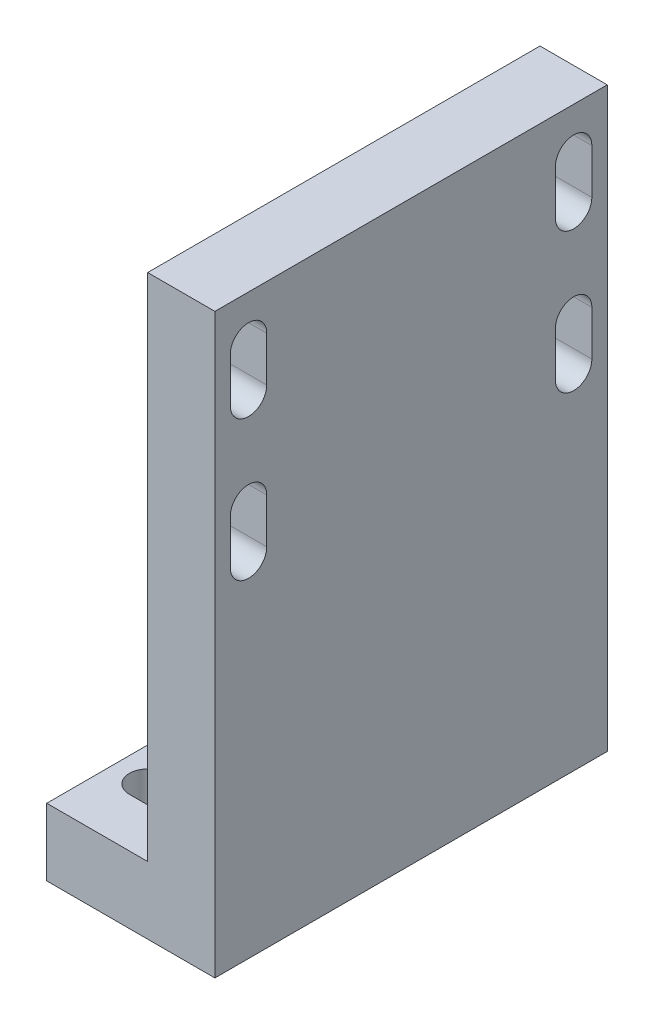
ISO-10303-21;
HEADER;
FILE_DESCRIPTION(('STEP AP214'),'2;1');
FILE_NAME('part.step','',(''),(''),'','','');
FILE_SCHEMA(('AUTOMOTIVE_DESIGN { 1 0 10303 214 1 1 1 1 }'));
ENDSEC;
DATA;
#1=APPLICATION_CONTEXT('core data for automotive mechanical design processes');
#2=APPLICATION_PROTOCOL_DEFINITION('international standard','automotive_design',2000,#1);
#3=PRODUCT_CONTEXT('',#1,'mechanical');
#4=PRODUCT('Part','Part','',(#3));
#5=PRODUCT_RELATED_PRODUCT_CATEGORY('part','',(#4));
#6=PRODUCT_DEFINITION_FORMATION('','',#4);
#7=PRODUCT_DEFINITION_CONTEXT('part definition',#1,'design');
#8=PRODUCT_DEFINITION('design','',#6,#7);
#9=PRODUCT_DEFINITION_SHAPE('','',#8);
#10=(LENGTH_UNIT() NAMED_UNIT(*) SI_UNIT(.MILLI.,.METRE.));
#11=(NAMED_UNIT(*) PLANE_ANGLE_UNIT() SI_UNIT($,.RADIAN.));
#12=(NAMED_UNIT(*) SI_UNIT($,.STERADIAN.) SOLID_ANGLE_UNIT());
#13=UNCERTAINTY_MEASURE_WITH_UNIT(LENGTH_MEASURE(1.E-05),#10,'distance_accuracy_value','');
#14=(GEOMETRIC_REPRESENTATION_CONTEXT(3) GLOBAL_UNCERTAINTY_ASSIGNED_CONTEXT((#13)) GLOBAL_UNIT_ASSIGNED_CONTEXT((#10,
#11,#12)) REPRESENTATION_CONTEXT('',''));
#15=CARTESIAN_POINT('',(0.,0.,0.));
#16=DIRECTION('',(0.,0.,1.));
#17=DIRECTION('',(1.,0.,0.));
#18=AXIS2_PLACEMENT_3D('',#15,#16,#17);
#19=CARTESIAN_POINT('',(-18.,-39.5,-35.));
#20=DIRECTION('',(0.,-1.,0.));
#21=DIRECTION('',(0.,0.,-1.));
#22=AXIS2_PLACEMENT_3D('',#19,#20,#21);
#23=PLANE('',#22);
#24=DIRECTION('',(1.,0.,0.));
#25=VECTOR('',#24,1.);
#26=CARTESIAN_POINT('',(-12.,-39.5,19.75));
#27=LINE('',#26,#25);
#28=CARTESIAN_POINT('',(-6.,-39.5,19.75));
#29=VERTEX_POINT('',#28);
#30=CARTESIAN_POINT('',(-12.,-39.5,19.75));
#31=VERTEX_POINT('',#30);
#32=EDGE_CURVE('E198',#29,#31,#27,.F.);
#33=ORIENTED_EDGE('',*,*,#32,.F.);
#34=CARTESIAN_POINT('',(-6.,-39.5,23.));
#35=DIRECTION('',(0.,1.,0.));
#36=DIRECTION('',(0.,0.,1.));
#37=AXIS2_PLACEMENT_3D('',#34,#35,#36);
#38=CIRCLE('',#37,3.25);
#39=CARTESIAN_POINT('',(-6.,-39.5,26.25));
#40=VERTEX_POINT('',#39);
#41=EDGE_CURVE('E240',#29,#40,#38,.F.);
#42=ORIENTED_EDGE('',*,*,#41,.T.);
#43=DIRECTION('',(-1.,0.,0.));
#44=VECTOR('',#43,1.);
#45=CARTESIAN_POINT('',(-12.,-39.5,26.25));
#46=LINE('',#45,#44);
#47=CARTESIAN_POINT('',(-12.,-39.5,26.25));
#48=VERTEX_POINT('',#47);
#49=EDGE_CURVE('E236',#48,#40,#46,.F.);
#50=ORIENTED_EDGE('',*,*,#49,.F.);
#51=CARTESIAN_POINT('',(-12.,-39.5,23.));
#52=DIRECTION('',(0.,1.,0.));
#53=DIRECTION('',(0.,0.,1.));
#54=AXIS2_PLACEMENT_3D('',#51,#52,#53);
#55=CIRCLE('',#54,3.25);
#56=EDGE_CURVE('E317',#48,#31,#55,.F.);
#57=ORIENTED_EDGE('',*,*,#56,.T.);
#58=EDGE_LOOP('',(#33,#42,#50,#57));
#59=FACE_BOUND('',#58,.T.);
#60=CARTESIAN_POINT('',(-12.,-39.5,-23.));
#61=DIRECTION('',(0.,1.,0.));
#62=DIRECTION('',(0.,0.,1.));
#63=AXIS2_PLACEMENT_3D('',#60,#61,#62);
#64=CIRCLE('',#63,3.25);
#65=CARTESIAN_POINT('',(-12.,-39.5,-19.75));
#66=VERTEX_POINT('',#65);
#67=CARTESIAN_POINT('',(-12.,-39.5,-26.25));
#68=VERTEX_POINT('',#67);
#69=EDGE_CURVE('E194',#66,#68,#64,.F.);
#70=ORIENTED_EDGE('',*,*,#69,.T.);
#71=DIRECTION('',(-1.,0.,0.));
#72=VECTOR('',#71,1.);
#73=CARTESIAN_POINT('',(-12.,-39.5,-26.25));
#74=LINE('',#73,#72);
#75=CARTESIAN_POINT('',(-6.,-39.5,-26.25));
#76=VERTEX_POINT('',#75);
#77=EDGE_CURVE('E191',#68,#76,#74,.F.);
#78=ORIENTED_EDGE('',*,*,#77,.T.);
#79=CARTESIAN_POINT('',(-6.,-39.5,-23.));
#80=DIRECTION('',(0.,1.,0.));
#81=DIRECTION('',(0.,0.,1.));
#82=AXIS2_PLACEMENT_3D('',#79,#80,#81);
#83=CIRCLE('',#82,3.25);
#84=CARTESIAN_POINT('',(-6.,-39.5,-19.75));
#85=VERTEX_POINT('',#84);
#86=EDGE_CURVE('E20',#76,#85,#83,.F.);
#87=ORIENTED_EDGE('',*,*,#86,.T.);
#88=DIRECTION('',(1.,0.,0.));
#89=VECTOR('',#88,1.);
#90=CARTESIAN_POINT('',(-12.,-39.5,-19.75));
#91=LINE('',#90,#89);
#92=EDGE_CURVE('E212',#85,#66,#91,.F.);
#93=ORIENTED_EDGE('',*,*,#92,.T.);
#94=EDGE_LOOP('',(#70,#78,#87,#93));
#95=FACE_BOUND('',#94,.T.);
#96=DIRECTION('',(1.,0.,0.));
#97=VECTOR('',#96,1.);
#98=CARTESIAN_POINT('',(12.,-39.5,-35.));
#99=LINE('',#98,#97);
#100=CARTESIAN_POINT('',(0.,-39.5,-35.));
#101=VERTEX_POINT('',#100);
#102=CARTESIAN_POINT('',(-18.,-39.5,-35.));
#103=VERTEX_POINT('',#102);
#104=EDGE_CURVE('E360',#101,#103,#99,.F.);
#105=ORIENTED_EDGE('',*,*,#104,.T.);
#106=DIRECTION('',(0.,0.,-1.));
#107=VECTOR('',#106,1.);
#108=CARTESIAN_POINT('',(-18.,-39.5,0.));
#109=LINE('',#108,#107);
#110=CARTESIAN_POINT('',(-18.,-39.5,35.));
#111=VERTEX_POINT('',#110);
#112=EDGE_CURVE('E189',#103,#111,#109,.F.);
#113=ORIENTED_EDGE('',*,*,#112,.T.);
#114=DIRECTION('',(1.,0.,0.));
#115=VECTOR('',#114,1.);
#116=CARTESIAN_POINT('',(12.,-39.5,35.));
#117=LINE('',#116,#115);
#118=CARTESIAN_POINT('',(0.,-39.5,35.));
#119=VERTEX_POINT('',#118);
#120=EDGE_CURVE('E378',#111,#119,#117,.T.);
#121=ORIENTED_EDGE('',*,*,#120,.T.);
#122=DIRECTION('',(0.,0.,-1.));
#123=VECTOR('',#122,1.);
#124=CARTESIAN_POINT('',(0.,-39.5,0.));
#125=LINE('',#124,#123);
#126=EDGE_CURVE('E316',#119,#101,#125,.T.);
#127=ORIENTED_EDGE('',*,*,#126,.T.);
#128=EDGE_LOOP('',(#105,#113,#121,#127));
#129=FACE_BOUND('',#128,.T.);
#130=ADVANCED_FACE('F17',(#59,#95,#129),#23,.F.);
#131=CARTESIAN_POINT('',(-18.,0.,0.));
#132=DIRECTION('',(1.,0.,0.));
#133=DIRECTION('',(0.,0.,-1.));
#134=AXIS2_PLACEMENT_3D('',#131,#132,#133);
#135=PLANE('',#134);
#136=DIRECTION('',(0.,0.,1.));
#137=VECTOR('',#136,1.);
#138=CARTESIAN_POINT('',(-18.,-51.5,35.));
#139=LINE('',#138,#137);
#140=CARTESIAN_POINT('',(-18.,-51.5,-35.));
#141=VERTEX_POINT('',#140);
#142=CARTESIAN_POINT('',(-18.,-51.5,35.));
#143=VERTEX_POINT('',#142);
#144=EDGE_CURVE('E387',#141,#143,#139,.T.);
#145=ORIENTED_EDGE('',*,*,#144,.T.);
#146=DIRECTION('',(0.,1.,0.));
#147=VECTOR('',#146,1.);
#148=CARTESIAN_POINT('',(-18.,51.5,35.));
#149=LINE('',#148,#147);
#150=EDGE_CURVE('E375',#143,#111,#149,.T.);
#151=ORIENTED_EDGE('',*,*,#150,.T.);
#152=ORIENTED_EDGE('',*,*,#112,.F.);
#153=DIRECTION('',(0.,-1.,0.));
#154=VECTOR('',#153,1.);
#155=CARTESIAN_POINT('',(-18.,51.5,-35.));
#156=LINE('',#155,#154);
#157=EDGE_CURVE('E363',#103,#141,#156,.T.);
#158=ORIENTED_EDGE('',*,*,#157,.T.);
#159=EDGE_LOOP('',(#145,#151,#152,#158));
#160=FACE_BOUND('',#159,.T.);
#161=ADVANCED_FACE('F729',(#160),#135,.F.);
#162=CARTESIAN_POINT('',(-6.,-51.5,-23.));
#163=DIRECTION('',(0.,1.,0.));
#164=DIRECTION('',(0.,0.,1.));
#165=AXIS2_PLACEMENT_3D('',#162,#163,#164);
#166=CYLINDRICAL_SURFACE('',#165,3.25);
#167=DIRECTION('',(0.,1.,0.));
#168=VECTOR('',#167,1.);
#169=CARTESIAN_POINT('',(-6.,-51.5,-26.25));
#170=LINE('',#169,#168);
#171=CARTESIAN_POINT('',(-6.,-51.5,-26.25));
#172=VERTEX_POINT('',#171);
#173=EDGE_CURVE('E183',#76,#172,#170,.F.);
#174=ORIENTED_EDGE('',*,*,#173,.T.);
#175=CARTESIAN_POINT('',(-6.,-51.5,-23.));
#176=DIRECTION('',(0.,1.,0.));
#177=DIRECTION('',(0.,0.,1.));
#178=AXIS2_PLACEMENT_3D('',#175,#176,#177);
#179=CIRCLE('',#178,3.25);
#180=CARTESIAN_POINT('',(-6.,-51.5,-19.75));
#181=VERTEX_POINT('',#180);
#182=EDGE_CURVE('E302',#172,#181,#179,.F.);
#183=ORIENTED_EDGE('',*,*,#182,.T.);
#184=DIRECTION('',(0.,1.,0.));
#185=VECTOR('',#184,1.);
#186=CARTESIAN_POINT('',(-6.,-51.5,-19.75));
#187=LINE('',#186,#185);
#188=EDGE_CURVE('E186',#181,#85,#187,.T.);
#189=ORIENTED_EDGE('',*,*,#188,.T.);
#190=ORIENTED_EDGE('',*,*,#86,.F.);
#191=EDGE_LOOP('',(#174,#183,#189,#190));
#192=FACE_BOUND('',#191,.T.);
#193=ADVANCED_FACE('F181',(#192),#166,.F.);
#194=CARTESIAN_POINT('',(-12.,-51.5,-19.75));
#195=DIRECTION('',(0.,0.,1.));
#196=DIRECTION('',(1.,0.,0.));
#197=AXIS2_PLACEMENT_3D('',#194,#195,#196);
#198=PLANE('',#197);
#199=ORIENTED_EDGE('',*,*,#188,.F.);
#200=DIRECTION('',(1.,0.,0.));
#201=VECTOR('',#200,1.);
#202=CARTESIAN_POINT('',(12.,-51.5,-19.75));
#203=LINE('',#202,#201);
#204=CARTESIAN_POINT('',(-12.,-51.5,-19.75));
#205=VERTEX_POINT('',#204);
#206=EDGE_CURVE('E301',#181,#205,#203,.F.);
#207=ORIENTED_EDGE('',*,*,#206,.T.);
#208=DIRECTION('',(0.,1.,0.));
#209=VECTOR('',#208,1.);
#210=CARTESIAN_POINT('',(-12.,-51.5,-19.75));
#211=LINE('',#210,#209);
#212=EDGE_CURVE('E207',#205,#66,#211,.T.);
#213=ORIENTED_EDGE('',*,*,#212,.T.);
#214=ORIENTED_EDGE('',*,*,#92,.F.);
#215=EDGE_LOOP('',(#199,#207,#213,#214));
#216=FACE_BOUND('',#215,.T.);
#217=ADVANCED_FACE('F710',(#216),#198,.F.);
#218=CARTESIAN_POINT('',(-12.,-51.5,-23.));
#219=DIRECTION('',(0.,1.,0.));
#220=DIRECTION('',(0.,0.,1.));
#221=AXIS2_PLACEMENT_3D('',#218,#219,#220);
#222=CYLINDRICAL_SURFACE('',#221,3.25);
#223=ORIENTED_EDGE('',*,*,#212,.F.);
#224=CARTESIAN_POINT('',(-12.,-51.5,-23.));
#225=DIRECTION('',(0.,1.,0.));
#226=DIRECTION('',(0.,0.,1.));
#227=AXIS2_PLACEMENT_3D('',#224,#225,#226);
#228=CIRCLE('',#227,3.25);
#229=CARTESIAN_POINT('',(-12.,-51.5,-26.25));
#230=VERTEX_POINT('',#229);
#231=EDGE_CURVE('E299',#205,#230,#228,.F.);
#232=ORIENTED_EDGE('',*,*,#231,.T.);
#233=DIRECTION('',(0.,1.,0.));
#234=VECTOR('',#233,1.);
#235=CARTESIAN_POINT('',(-12.,-51.5,-26.25));
#236=LINE('',#235,#234);
#237=EDGE_CURVE('E199',#230,#68,#236,.T.);
#238=ORIENTED_EDGE('',*,*,#237,.T.);
#239=ORIENTED_EDGE('',*,*,#69,.F.);
#240=EDGE_LOOP('',(#223,#232,#238,#239));
#241=FACE_BOUND('',#240,.T.);
#242=ADVANCED_FACE('F701',(#241),#222,.F.);
#243=CARTESIAN_POINT('',(-12.,-51.5,-26.25));
#244=DIRECTION('',(0.,0.,-1.));
#245=DIRECTION('',(-1.,0.,0.));
#246=AXIS2_PLACEMENT_3D('',#243,#244,#245);
#247=PLANE('',#246);
#248=ORIENTED_EDGE('',*,*,#237,.F.);
#249=DIRECTION('',(1.,0.,0.));
#250=VECTOR('',#249,1.);
#251=CARTESIAN_POINT('',(12.,-51.5,-26.25));
#252=LINE('',#251,#250);
#253=EDGE_CURVE('E203',#230,#172,#252,.T.);
#254=ORIENTED_EDGE('',*,*,#253,.T.);
#255=ORIENTED_EDGE('',*,*,#173,.F.);
#256=ORIENTED_EDGE('',*,*,#77,.F.);
#257=EDGE_LOOP('',(#248,#254,#255,#256));
#258=FACE_BOUND('',#257,.T.);
#259=ADVANCED_FACE('F201',(#258),#247,.F.);
#260=CARTESIAN_POINT('',(-12.,-51.5,19.75));
#261=DIRECTION('',(0.,0.,1.));
#262=DIRECTION('',(1.,0.,0.));
#263=AXIS2_PLACEMENT_3D('',#260,#261,#262);
#264=PLANE('',#263);
#265=DIRECTION('',(1.,0.,0.));
#266=VECTOR('',#265,1.);
#267=CARTESIAN_POINT('',(12.,-51.5,19.75));
#268=LINE('',#267,#266);
#269=CARTESIAN_POINT('',(-12.,-51.5,19.75));
#270=VERTEX_POINT('',#269);
#271=CARTESIAN_POINT('',(-6.,-51.5,19.75));
#272=VERTEX_POINT('',#271);
#273=EDGE_CURVE('E298',#270,#272,#268,.T.);
#274=ORIENTED_EDGE('',*,*,#273,.T.);
#275=DIRECTION('',(0.,1.,0.));
#276=VECTOR('',#275,1.);
#277=CARTESIAN_POINT('',(-6.,-51.5,19.75));
#278=LINE('',#277,#276);
#279=EDGE_CURVE('E241',#272,#29,#278,.T.);
#280=ORIENTED_EDGE('',*,*,#279,.T.);
#281=ORIENTED_EDGE('',*,*,#32,.T.);
#282=DIRECTION('',(0.,1.,0.));
#283=VECTOR('',#282,1.);
#284=CARTESIAN_POINT('',(-12.,-51.5,19.75));
#285=LINE('',#284,#283);
#286=EDGE_CURVE('E330',#31,#270,#285,.F.);
#287=ORIENTED_EDGE('',*,*,#286,.T.);
#288=EDGE_LOOP('',(#274,#280,#281,#287));
#289=FACE_BOUND('',#288,.T.);
#290=ADVANCED_FACE('F683',(#289),#264,.T.);
#291=CARTESIAN_POINT('',(-6.,-51.5,23.));
#292=DIRECTION('',(0.,1.,0.));
#293=DIRECTION('',(0.,0.,1.));
#294=AXIS2_PLACEMENT_3D('',#291,#292,#293);
#295=CYLINDRICAL_SURFACE('',#294,3.25);
#296=ORIENTED_EDGE('',*,*,#279,.F.);
#297=CARTESIAN_POINT('',(-6.,-51.5,23.));
#298=DIRECTION('',(0.,1.,0.));
#299=DIRECTION('',(0.,0.,1.));
#300=AXIS2_PLACEMENT_3D('',#297,#298,#299);
#301=CIRCLE('',#300,3.25);
#302=CARTESIAN_POINT('',(-6.,-51.5,26.25));
#303=VERTEX_POINT('',#302);
#304=EDGE_CURVE('E296',#272,#303,#301,.F.);
#305=ORIENTED_EDGE('',*,*,#304,.T.);
#306=DIRECTION('',(0.,1.,0.));
#307=VECTOR('',#306,1.);
#308=CARTESIAN_POINT('',(-6.,-51.5,26.25));
#309=LINE('',#308,#307);
#310=EDGE_CURVE('E239',#40,#303,#309,.F.);
#311=ORIENTED_EDGE('',*,*,#310,.F.);
#312=ORIENTED_EDGE('',*,*,#41,.F.);
#313=EDGE_LOOP('',(#296,#305,#311,#312));
#314=FACE_BOUND('',#313,.T.);
#315=ADVANCED_FACE('F673',(#314),#295,.F.);
#316=CARTESIAN_POINT('',(-12.,-51.5,26.25));
#317=DIRECTION('',(0.,0.,-1.));
#318=DIRECTION('',(-1.,0.,0.));
#319=AXIS2_PLACEMENT_3D('',#316,#317,#318);
#320=PLANE('',#319);
#321=DIRECTION('',(1.,0.,0.));
#322=VECTOR('',#321,1.);
#323=CARTESIAN_POINT('',(12.,-51.5,26.25));
#324=LINE('',#323,#322);
#325=CARTESIAN_POINT('',(-12.,-51.5,26.25));
#326=VERTEX_POINT('',#325);
#327=EDGE_CURVE('E295',#303,#326,#324,.F.);
#328=ORIENTED_EDGE('',*,*,#327,.T.);
#329=DIRECTION('',(0.,1.,0.));
#330=VECTOR('',#329,1.);
#331=CARTESIAN_POINT('',(-12.,-51.5,26.25));
#332=LINE('',#331,#330);
#333=EDGE_CURVE('E320',#326,#48,#332,.T.);
#334=ORIENTED_EDGE('',*,*,#333,.T.);
#335=ORIENTED_EDGE('',*,*,#49,.T.);
#336=ORIENTED_EDGE('',*,*,#310,.T.);
#337=EDGE_LOOP('',(#328,#334,#335,#336));
#338=FACE_BOUND('',#337,.T.);
#339=ADVANCED_FACE('F663',(#338),#320,.T.);
#340=CARTESIAN_POINT('',(-12.,-51.5,23.));
#341=DIRECTION('',(0.,1.,0.));
#342=DIRECTION('',(0.,0.,1.));
#343=AXIS2_PLACEMENT_3D('',#340,#341,#342);
#344=CYLINDRICAL_SURFACE('',#343,3.25);
#345=ORIENTED_EDGE('',*,*,#333,.F.);
#346=CARTESIAN_POINT('',(-12.,-51.5,23.));
#347=DIRECTION('',(0.,1.,0.));
#348=DIRECTION('',(0.,0.,1.));
#349=AXIS2_PLACEMENT_3D('',#346,#347,#348);
#350=CIRCLE('',#349,3.25);
#351=EDGE_CURVE('E292',#326,#270,#350,.F.);
#352=ORIENTED_EDGE('',*,*,#351,.T.);
#353=ORIENTED_EDGE('',*,*,#286,.F.);
#354=ORIENTED_EDGE('',*,*,#56,.F.);
#355=EDGE_LOOP('',(#345,#352,#353,#354));
#356=FACE_BOUND('',#355,.T.);
#357=ADVANCED_FACE('F653',(#356),#344,.F.);
#358=CARTESIAN_POINT('',(0.,0.,0.));
#359=DIRECTION('',(1.,0.,0.));
#360=DIRECTION('',(0.,0.,-1.));
#361=AXIS2_PLACEMENT_3D('',#358,#359,#360);
#362=PLANE('',#361);
#363=DIRECTION('',(0.,1.,0.));
#364=VECTOR('',#363,1.);
#365=CARTESIAN_POINT('',(0.,51.5,35.));
#366=LINE('',#365,#364);
#367=CARTESIAN_POINT('',(0.,51.5,35.));
#368=VERTEX_POINT('',#367);
#369=EDGE_CURVE('E381',#119,#368,#366,.T.);
#370=ORIENTED_EDGE('',*,*,#369,.T.);
#371=DIRECTION('',(0.,0.,-1.));
#372=VECTOR('',#371,1.);
#373=CARTESIAN_POINT('',(0.,51.5,35.));
#374=LINE('',#373,#372);
#375=CARTESIAN_POINT('',(0.,51.5,-35.));
#376=VERTEX_POINT('',#375);
#377=EDGE_CURVE('E369',#368,#376,#374,.T.);
#378=ORIENTED_EDGE('',*,*,#377,.T.);
#379=DIRECTION('',(0.,-1.,0.));
#380=VECTOR('',#379,1.);
#381=CARTESIAN_POINT('',(0.,51.5,-35.));
#382=LINE('',#381,#380);
#383=EDGE_CURVE('E219',#376,#101,#382,.T.);
#384=ORIENTED_EDGE('',*,*,#383,.T.);
#385=ORIENTED_EDGE('',*,*,#126,.F.);
#386=EDGE_LOOP('',(#370,#378,#384,#385));
#387=FACE_BOUND('',#386,.T.);
#388=CARTESIAN_POINT('',(0.,43.5,29.));
#389=DIRECTION('',(-1.,0.,0.));
#390=DIRECTION('',(0.,0.,1.));
#391=AXIS2_PLACEMENT_3D('',#388,#389,#390);
#392=CIRCLE('',#391,3.25);
#393=CARTESIAN_POINT('',(0.,43.5,25.75));
#394=VERTEX_POINT('',#393);
#395=CARTESIAN_POINT('',(0.,43.5,32.25));
#396=VERTEX_POINT('',#395);
#397=EDGE_CURVE('E314',#394,#396,#392,.F.);
#398=ORIENTED_EDGE('',*,*,#397,.T.);
#399=DIRECTION('',(0.,-1.,0.));
#400=VECTOR('',#399,1.);
#401=CARTESIAN_POINT('',(0.,43.5,32.25));
#402=LINE('',#401,#400);
#403=CARTESIAN_POINT('',(0.,35.5,32.25));
#404=VERTEX_POINT('',#403);
#405=EDGE_CURVE('E226',#396,#404,#402,.T.);
#406=ORIENTED_EDGE('',*,*,#405,.T.);
#407=CARTESIAN_POINT('',(0.,35.5,29.));
#408=DIRECTION('',(-1.,0.,0.));
#409=DIRECTION('',(0.,0.,1.));
#410=AXIS2_PLACEMENT_3D('',#407,#408,#409);
#411=CIRCLE('',#410,3.25);
#412=CARTESIAN_POINT('',(0.,35.5,25.75));
#413=VERTEX_POINT('',#412);
#414=EDGE_CURVE('E310',#404,#413,#411,.F.);
#415=ORIENTED_EDGE('',*,*,#414,.T.);
#416=DIRECTION('',(0.,1.,0.));
#417=VECTOR('',#416,1.);
#418=CARTESIAN_POINT('',(0.,43.5,25.75));
#419=LINE('',#418,#417);
#420=EDGE_CURVE('E231',#413,#394,#419,.T.);
#421=ORIENTED_EDGE('',*,*,#420,.T.);
#422=EDGE_LOOP('',(#398,#406,#415,#421));
#423=FACE_BOUND('',#422,.T.);
#424=CARTESIAN_POINT('',(0.,43.5,-29.));
#425=DIRECTION('',(-1.,0.,0.));
#426=DIRECTION('',(0.,0.,1.));
#427=AXIS2_PLACEMENT_3D('',#424,#425,#426);
#428=CIRCLE('',#427,3.25);
#429=CARTESIAN_POINT('',(0.,43.5,-32.25));
#430=VERTEX_POINT('',#429);
#431=CARTESIAN_POINT('',(0.,43.5,-25.75));
#432=VERTEX_POINT('',#431);
#433=EDGE_CURVE('E229',#430,#432,#428,.F.);
#434=ORIENTED_EDGE('',*,*,#433,.T.);
#435=DIRECTION('',(0.,-1.,0.));
#436=VECTOR('',#435,1.);
#437=CARTESIAN_POINT('',(0.,43.5,-25.75));
#438=LINE('',#437,#436);
#439=CARTESIAN_POINT('',(0.,35.5,-25.75));
#440=VERTEX_POINT('',#439);
#441=EDGE_CURVE('E216',#432,#440,#438,.T.);
#442=ORIENTED_EDGE('',*,*,#441,.T.);
#443=CARTESIAN_POINT('',(0.,35.5,-29.));
#444=DIRECTION('',(-1.,0.,0.));
#445=DIRECTION('',(0.,0.,1.));
#446=AXIS2_PLACEMENT_3D('',#443,#444,#445);
#447=CIRCLE('',#446,3.25);
#448=CARTESIAN_POINT('',(0.,35.5,-32.25));
#449=VERTEX_POINT('',#448);
#450=EDGE_CURVE('E305',#440,#449,#447,.F.);
#451=ORIENTED_EDGE('',*,*,#450,.T.);
#452=DIRECTION('',(0.,1.,0.));
#453=VECTOR('',#452,1.);
#454=CARTESIAN_POINT('',(0.,43.5,-32.25));
#455=LINE('',#454,#453);
#456=EDGE_CURVE('E221',#449,#430,#455,.T.);
#457=ORIENTED_EDGE('',*,*,#456,.T.);
#458=EDGE_LOOP('',(#434,#442,#451,#457));
#459=FACE_BOUND('',#458,.T.);
#460=DIRECTION('',(0.,-1.,0.));
#461=VECTOR('',#460,1.);
#462=CARTESIAN_POINT('',(0.,18.5,-25.75));
#463=LINE('',#462,#461);
#464=CARTESIAN_POINT('',(0.,18.5,-25.75));
#465=VERTEX_POINT('',#464);
#466=CARTESIAN_POINT('',(0.,10.5,-25.75));
#467=VERTEX_POINT('',#466);
#468=EDGE_CURVE('E283',#465,#467,#463,.T.);
#469=ORIENTED_EDGE('',*,*,#468,.T.);
#470=CARTESIAN_POINT('',(0.,10.5,-29.));
#471=DIRECTION('',(-1.,0.,0.));
#472=DIRECTION('',(0.,0.,1.));
#473=AXIS2_PLACEMENT_3D('',#470,#471,#472);
#474=CIRCLE('',#473,3.25);
#475=CARTESIAN_POINT('',(0.,10.5,-32.25));
#476=VERTEX_POINT('',#475);
#477=EDGE_CURVE('E284',#467,#476,#474,.F.);
#478=ORIENTED_EDGE('',*,*,#477,.T.);
#479=DIRECTION('',(0.,1.,0.));
#480=VECTOR('',#479,1.);
#481=CARTESIAN_POINT('',(0.,18.5,-32.25));
#482=LINE('',#481,#480);
#483=CARTESIAN_POINT('',(0.,18.5,-32.25));
#484=VERTEX_POINT('',#483);
#485=EDGE_CURVE('E334',#476,#484,#482,.T.);
#486=ORIENTED_EDGE('',*,*,#485,.T.);
#487=CARTESIAN_POINT('',(0.,18.5,-29.));
#488=DIRECTION('',(-1.,0.,0.));
#489=DIRECTION('',(0.,0.,1.));
#490=AXIS2_PLACEMENT_3D('',#487,#488,#489);
#491=CIRCLE('',#490,3.25);
#492=EDGE_CURVE('E289',#484,#465,#491,.F.);
#493=ORIENTED_EDGE('',*,*,#492,.T.);
#494=EDGE_LOOP('',(#469,#478,#486,#493));
#495=FACE_BOUND('',#494,.T.);
#496=DIRECTION('',(0.,-1.,0.));
#497=VECTOR('',#496,1.);
#498=CARTESIAN_POINT('',(0.,18.5,32.25));
#499=LINE('',#498,#497);
#500=CARTESIAN_POINT('',(0.,18.5,32.25));
#501=VERTEX_POINT('',#500);
#502=CARTESIAN_POINT('',(0.,10.5,32.25));
#503=VERTEX_POINT('',#502);
#504=EDGE_CURVE('E275',#501,#503,#499,.T.);
#505=ORIENTED_EDGE('',*,*,#504,.T.);
#506=CARTESIAN_POINT('',(0.,10.5,29.));
#507=DIRECTION('',(-1.,0.,0.));
#508=DIRECTION('',(0.,0.,1.));
#509=AXIS2_PLACEMENT_3D('',#506,#507,#508);
#510=CIRCLE('',#509,3.25);
#511=CARTESIAN_POINT('',(0.,10.5,25.75));
#512=VERTEX_POINT('',#511);
#513=EDGE_CURVE('E276',#503,#512,#510,.F.);
#514=ORIENTED_EDGE('',*,*,#513,.T.);
#515=DIRECTION('',(0.,1.,0.));
#516=VECTOR('',#515,1.);
#517=CARTESIAN_POINT('',(0.,18.5,25.75));
#518=LINE('',#517,#516);
#519=CARTESIAN_POINT('',(0.,18.5,25.75));
#520=VERTEX_POINT('',#519);
#521=EDGE_CURVE('E340',#512,#520,#518,.T.);
#522=ORIENTED_EDGE('',*,*,#521,.T.);
#523=CARTESIAN_POINT('',(0.,18.5,29.));
#524=DIRECTION('',(-1.,0.,0.));
#525=DIRECTION('',(0.,0.,1.));
#526=AXIS2_PLACEMENT_3D('',#523,#524,#525);
#527=CIRCLE('',#526,3.25);
#528=EDGE_CURVE('E280',#520,#501,#527,.F.);
#529=ORIENTED_EDGE('',*,*,#528,.T.);
#530=EDGE_LOOP('',(#505,#514,#522,#529));
#531=FACE_BOUND('',#530,.T.);
#532=ADVANCED_FACE('F643',(#387,#423,#459,#495,#531),#362,.F.);
#533=CARTESIAN_POINT('',(12.,43.5,29.));
#534=DIRECTION('',(-1.,0.,0.));
#535=DIRECTION('',(0.,0.,1.));
#536=AXIS2_PLACEMENT_3D('',#533,#534,#535);
#537=CYLINDRICAL_SURFACE('',#536,3.25);
#538=DIRECTION('',(1.,0.,0.));
#539=VECTOR('',#538,1.);
#540=CARTESIAN_POINT('',(12.,43.5,25.75));
#541=LINE('',#540,#539);
#542=CARTESIAN_POINT('',(12.,43.5,25.75));
#543=VERTEX_POINT('',#542);
#544=EDGE_CURVE('E235',#394,#543,#541,.T.);
#545=ORIENTED_EDGE('',*,*,#544,.T.);
#546=CARTESIAN_POINT('',(12.,43.5,29.));
#547=DIRECTION('',(-1.,0.,0.));
#548=DIRECTION('',(0.,0.,1.));
#549=AXIS2_PLACEMENT_3D('',#546,#547,#548);
#550=CIRCLE('',#549,3.25);
#551=CARTESIAN_POINT('',(12.,43.5,32.25));
#552=VERTEX_POINT('',#551);
#553=EDGE_CURVE('E272',#552,#543,#550,.T.);
#554=ORIENTED_EDGE('',*,*,#553,.F.);
#555=DIRECTION('',(1.,0.,0.));
#556=VECTOR('',#555,1.);
#557=CARTESIAN_POINT('',(12.,43.5,32.25));
#558=LINE('',#557,#556);
#559=EDGE_CURVE('E230',#552,#396,#558,.F.);
#560=ORIENTED_EDGE('',*,*,#559,.T.);
#561=ORIENTED_EDGE('',*,*,#397,.F.);
#562=EDGE_LOOP('',(#545,#554,#560,#561));
#563=FACE_BOUND('',#562,.T.);
#564=ADVANCED_FACE('F633',(#563),#537,.F.);
#565=CARTESIAN_POINT('',(12.,43.5,25.75));
#566=DIRECTION('',(0.,0.,-1.));
#567=DIRECTION('',(0.,1.,0.));
#568=AXIS2_PLACEMENT_3D('',#565,#566,#567);
#569=PLANE('',#568);
#570=DIRECTION('',(-1.,0.,0.));
#571=VECTOR('',#570,1.);
#572=CARTESIAN_POINT('',(12.,35.5,25.75));
#573=LINE('',#572,#571);
#574=CARTESIAN_POINT('',(12.,35.5,25.75));
#575=VERTEX_POINT('',#574);
#576=EDGE_CURVE('E234',#413,#575,#573,.F.);
#577=ORIENTED_EDGE('',*,*,#576,.T.);
#578=DIRECTION('',(0.,1.,0.));
#579=VECTOR('',#578,1.);
#580=CARTESIAN_POINT('',(12.,0.,25.75));
#581=LINE('',#580,#579);
#582=EDGE_CURVE('E271',#543,#575,#581,.F.);
#583=ORIENTED_EDGE('',*,*,#582,.F.);
#584=ORIENTED_EDGE('',*,*,#544,.F.);
#585=ORIENTED_EDGE('',*,*,#420,.F.);
#586=EDGE_LOOP('',(#577,#583,#584,#585));
#587=FACE_BOUND('',#586,.T.);
#588=ADVANCED_FACE('F623',(#587),#569,.F.);
#589=CARTESIAN_POINT('',(12.,35.5,29.));
#590=DIRECTION('',(-1.,0.,0.));
#591=DIRECTION('',(0.,0.,1.));
#592=AXIS2_PLACEMENT_3D('',#589,#590,#591);
#593=CYLINDRICAL_SURFACE('',#592,3.25);
#594=DIRECTION('',(1.,0.,0.));
#595=VECTOR('',#594,1.);
#596=CARTESIAN_POINT('',(12.,35.5,32.25));
#597=LINE('',#596,#595);
#598=CARTESIAN_POINT('',(12.,35.5,32.25));
#599=VERTEX_POINT('',#598);
#600=EDGE_CURVE('E313',#404,#599,#597,.T.);
#601=ORIENTED_EDGE('',*,*,#600,.T.);
#602=CARTESIAN_POINT('',(12.,35.5,29.));
#603=DIRECTION('',(-1.,0.,0.));
#604=DIRECTION('',(0.,0.,1.));
#605=AXIS2_PLACEMENT_3D('',#602,#603,#604);
#606=CIRCLE('',#605,3.25);
#607=EDGE_CURVE('E268',#575,#599,#606,.T.);
#608=ORIENTED_EDGE('',*,*,#607,.F.);
#609=ORIENTED_EDGE('',*,*,#576,.F.);
#610=ORIENTED_EDGE('',*,*,#414,.F.);
#611=EDGE_LOOP('',(#601,#608,#609,#610));
#612=FACE_BOUND('',#611,.T.);
#613=ADVANCED_FACE('F613',(#612),#593,.F.);
#614=CARTESIAN_POINT('',(12.,43.5,32.25));
#615=DIRECTION('',(0.,0.,1.));
#616=DIRECTION('',(0.,-1.,0.));
#617=AXIS2_PLACEMENT_3D('',#614,#615,#616);
#618=PLANE('',#617);
#619=ORIENTED_EDGE('',*,*,#559,.F.);
#620=DIRECTION('',(0.,1.,0.));
#621=VECTOR('',#620,1.);
#622=CARTESIAN_POINT('',(12.,0.,32.25));
#623=LINE('',#622,#621);
#624=EDGE_CURVE('E267',#599,#552,#623,.T.);
#625=ORIENTED_EDGE('',*,*,#624,.F.);
#626=ORIENTED_EDGE('',*,*,#600,.F.);
#627=ORIENTED_EDGE('',*,*,#405,.F.);
#628=EDGE_LOOP('',(#619,#625,#626,#627));
#629=FACE_BOUND('',#628,.T.);
#630=ADVANCED_FACE('F603',(#629),#618,.F.);
#631=CARTESIAN_POINT('',(12.,43.5,-29.));
#632=DIRECTION('',(-1.,0.,0.));
#633=DIRECTION('',(0.,0.,1.));
#634=AXIS2_PLACEMENT_3D('',#631,#632,#633);
#635=CYLINDRICAL_SURFACE('',#634,3.25);
#636=DIRECTION('',(1.,0.,0.));
#637=VECTOR('',#636,1.);
#638=CARTESIAN_POINT('',(12.,43.5,-32.25));
#639=LINE('',#638,#637);
#640=CARTESIAN_POINT('',(12.,43.5,-32.25));
#641=VERTEX_POINT('',#640);
#642=EDGE_CURVE('E225',#430,#641,#639,.T.);
#643=ORIENTED_EDGE('',*,*,#642,.T.);
#644=CARTESIAN_POINT('',(12.,43.5,-29.));
#645=DIRECTION('',(-1.,0.,0.));
#646=DIRECTION('',(0.,0.,1.));
#647=AXIS2_PLACEMENT_3D('',#644,#645,#646);
#648=CIRCLE('',#647,3.25);
#649=CARTESIAN_POINT('',(12.,43.5,-25.75));
#650=VERTEX_POINT('',#649);
#651=EDGE_CURVE('E264',#650,#641,#648,.T.);
#652=ORIENTED_EDGE('',*,*,#651,.F.);
#653=DIRECTION('',(1.,0.,0.));
#654=VECTOR('',#653,1.);
#655=CARTESIAN_POINT('',(12.,43.5,-25.75));
#656=LINE('',#655,#654);
#657=EDGE_CURVE('E220',#650,#432,#656,.F.);
#658=ORIENTED_EDGE('',*,*,#657,.T.);
#659=ORIENTED_EDGE('',*,*,#433,.F.);
#660=EDGE_LOOP('',(#643,#652,#658,#659));
#661=FACE_BOUND('',#660,.T.);
#662=ADVANCED_FACE('F593',(#661),#635,.F.);
#663=CARTESIAN_POINT('',(12.,43.5,-32.25));
#664=DIRECTION('',(0.,0.,-1.));
#665=DIRECTION('',(0.,1.,0.));
#666=AXIS2_PLACEMENT_3D('',#663,#664,#665);
#667=PLANE('',#666);
#668=DIRECTION('',(-1.,0.,0.));
#669=VECTOR('',#668,1.);
#670=CARTESIAN_POINT('',(12.,35.5,-32.25));
#671=LINE('',#670,#669);
#672=CARTESIAN_POINT('',(12.,35.5,-32.25));
#673=VERTEX_POINT('',#672);
#674=EDGE_CURVE('E224',#449,#673,#671,.F.);
#675=ORIENTED_EDGE('',*,*,#674,.T.);
#676=DIRECTION('',(0.,1.,0.));
#677=VECTOR('',#676,1.);
#678=CARTESIAN_POINT('',(12.,0.,-32.25));
#679=LINE('',#678,#677);
#680=EDGE_CURVE('E263',#641,#673,#679,.F.);
#681=ORIENTED_EDGE('',*,*,#680,.F.);
#682=ORIENTED_EDGE('',*,*,#642,.F.);
#683=ORIENTED_EDGE('',*,*,#456,.F.);
#684=EDGE_LOOP('',(#675,#681,#682,#683));
#685=FACE_BOUND('',#684,.T.);
#686=ADVANCED_FACE('F583',(#685),#667,.F.);
#687=CARTESIAN_POINT('',(12.,35.5,-29.));
#688=DIRECTION('',(-1.,0.,0.));
#689=DIRECTION('',(0.,0.,1.));
#690=AXIS2_PLACEMENT_3D('',#687,#688,#689);
#691=CYLINDRICAL_SURFACE('',#690,3.25);
#692=DIRECTION('',(1.,0.,0.));
#693=VECTOR('',#692,1.);
#694=CARTESIAN_POINT('',(12.,35.5,-25.75));
#695=LINE('',#694,#693);
#696=CARTESIAN_POINT('',(12.,35.5,-25.75));
#697=VERTEX_POINT('',#696);
#698=EDGE_CURVE('E308',#440,#697,#695,.T.);
#699=ORIENTED_EDGE('',*,*,#698,.T.);
#700=CARTESIAN_POINT('',(12.,35.5,-29.));
#701=DIRECTION('',(-1.,0.,0.));
#702=DIRECTION('',(0.,0.,1.));
#703=AXIS2_PLACEMENT_3D('',#700,#701,#702);
#704=CIRCLE('',#703,3.25);
#705=EDGE_CURVE('E259',#673,#697,#704,.T.);
#706=ORIENTED_EDGE('',*,*,#705,.F.);
#707=ORIENTED_EDGE('',*,*,#674,.F.);
#708=ORIENTED_EDGE('',*,*,#450,.F.);
#709=EDGE_LOOP('',(#699,#706,#707,#708));
#710=FACE_BOUND('',#709,.T.);
#711=ADVANCED_FACE('F573',(#710),#691,.F.);
#712=CARTESIAN_POINT('',(12.,43.5,-25.75));
#713=DIRECTION('',(0.,0.,1.));
#714=DIRECTION('',(0.,-1.,0.));
#715=AXIS2_PLACEMENT_3D('',#712,#713,#714);
#716=PLANE('',#715);
#717=ORIENTED_EDGE('',*,*,#657,.F.);
#718=DIRECTION('',(0.,1.,0.));
#719=VECTOR('',#718,1.);
#720=CARTESIAN_POINT('',(12.,0.,-25.75));
#721=LINE('',#720,#719);
#722=EDGE_CURVE('E262',#697,#650,#721,.T.);
#723=ORIENTED_EDGE('',*,*,#722,.F.);
#724=ORIENTED_EDGE('',*,*,#698,.F.);
#725=ORIENTED_EDGE('',*,*,#441,.F.);
#726=EDGE_LOOP('',(#717,#723,#724,#725));
#727=FACE_BOUND('',#726,.T.);
#728=ADVANCED_FACE('F563',(#727),#716,.F.);
#729=CARTESIAN_POINT('',(12.,51.5,-35.));
#730=DIRECTION('',(0.,0.,1.));
#731=DIRECTION('',(0.,-1.,0.));
#732=AXIS2_PLACEMENT_3D('',#729,#730,#731);
#733=PLANE('',#732);
#734=ORIENTED_EDGE('',*,*,#157,.F.);
#735=ORIENTED_EDGE('',*,*,#104,.F.);
#736=ORIENTED_EDGE('',*,*,#383,.F.);
#737=DIRECTION('',(1.,0.,0.));
#738=VECTOR('',#737,1.);
#739=CARTESIAN_POINT('',(12.,51.5,-35.));
#740=LINE('',#739,#738);
#741=CARTESIAN_POINT('',(12.,51.5,-35.));
#742=VERTEX_POINT('',#741);
#743=EDGE_CURVE('E366',#376,#742,#740,.T.);
#744=ORIENTED_EDGE('',*,*,#743,.T.);
#745=DIRECTION('',(0.,1.,0.));
#746=VECTOR('',#745,1.);
#747=CARTESIAN_POINT('',(12.,0.,-35.));
#748=LINE('',#747,#746);
#749=CARTESIAN_POINT('',(12.,-51.5,-35.));
#750=VERTEX_POINT('',#749);
#751=EDGE_CURVE('E414',#750,#742,#748,.T.);
#752=ORIENTED_EDGE('',*,*,#751,.F.);
#753=DIRECTION('',(1.,0.,0.));
#754=VECTOR('',#753,1.);
#755=CARTESIAN_POINT('',(12.,-51.5,-35.));
#756=LINE('',#755,#754);
#757=EDGE_CURVE('E384',#750,#141,#756,.F.);
#758=ORIENTED_EDGE('',*,*,#757,.T.);
#759=EDGE_LOOP('',(#734,#735,#736,#744,#752,#758));
#760=FACE_BOUND('',#759,.T.);
#761=ADVANCED_FACE('F553',(#760),#733,.F.);
#762=CARTESIAN_POINT('',(12.,51.5,35.));
#763=DIRECTION('',(0.,-1.,0.));
#764=DIRECTION('',(0.,0.,-1.));
#765=AXIS2_PLACEMENT_3D('',#762,#763,#764);
#766=PLANE('',#765);
#767=DIRECTION('',(1.,0.,0.));
#768=VECTOR('',#767,1.);
#769=CARTESIAN_POINT('',(12.,51.5,35.));
#770=LINE('',#769,#768);
#771=CARTESIAN_POINT('',(12.,51.5,35.));
#772=VERTEX_POINT('',#771);
#773=EDGE_CURVE('E372',#368,#772,#770,.T.);
#774=ORIENTED_EDGE('',*,*,#773,.T.);
#775=DIRECTION('',(0.,0.,-1.));
#776=VECTOR('',#775,1.);
#777=CARTESIAN_POINT('',(12.,51.5,0.));
#778=LINE('',#777,#776);
#779=EDGE_CURVE('E417',#742,#772,#778,.F.);
#780=ORIENTED_EDGE('',*,*,#779,.F.);
#781=ORIENTED_EDGE('',*,*,#743,.F.);
#782=ORIENTED_EDGE('',*,*,#377,.F.);
#783=EDGE_LOOP('',(#774,#780,#781,#782));
#784=FACE_BOUND('',#783,.T.);
#785=ADVANCED_FACE('F543',(#784),#766,.F.);
#786=CARTESIAN_POINT('',(12.,51.5,35.));
#787=DIRECTION('',(0.,0.,-1.));
#788=DIRECTION('',(0.,1.,0.));
#789=AXIS2_PLACEMENT_3D('',#786,#787,#788);
#790=PLANE('',#789);
#791=ORIENTED_EDGE('',*,*,#120,.F.);
#792=ORIENTED_EDGE('',*,*,#150,.F.);
#793=DIRECTION('',(1.,0.,0.));
#794=VECTOR('',#793,1.);
#795=CARTESIAN_POINT('',(12.,-51.5,35.));
#796=LINE('',#795,#794);
#797=CARTESIAN_POINT('',(12.,-51.5,35.));
#798=VERTEX_POINT('',#797);
#799=EDGE_CURVE('E304',#143,#798,#796,.T.);
#800=ORIENTED_EDGE('',*,*,#799,.T.);
#801=DIRECTION('',(0.,1.,0.));
#802=VECTOR('',#801,1.);
#803=CARTESIAN_POINT('',(12.,0.,35.));
#804=LINE('',#803,#802);
#805=EDGE_CURVE('E420',#772,#798,#804,.F.);
#806=ORIENTED_EDGE('',*,*,#805,.F.);
#807=ORIENTED_EDGE('',*,*,#773,.F.);
#808=ORIENTED_EDGE('',*,*,#369,.F.);
#809=EDGE_LOOP('',(#791,#792,#800,#806,#807,#808));
#810=FACE_BOUND('',#809,.T.);
#811=ADVANCED_FACE('F533',(#810),#790,.F.);
#812=CARTESIAN_POINT('',(12.,-51.5,35.));
#813=DIRECTION('',(0.,1.,0.));
#814=DIRECTION('',(0.,0.,1.));
#815=AXIS2_PLACEMENT_3D('',#812,#813,#814);
#816=PLANE('',#815);
#817=ORIENTED_EDGE('',*,*,#327,.F.);
#818=ORIENTED_EDGE('',*,*,#304,.F.);
#819=ORIENTED_EDGE('',*,*,#273,.F.);
#820=ORIENTED_EDGE('',*,*,#351,.F.);
#821=EDGE_LOOP('',(#817,#818,#819,#820));
#822=FACE_BOUND('',#821,.T.);
#823=ORIENTED_EDGE('',*,*,#231,.F.);
#824=ORIENTED_EDGE('',*,*,#206,.F.);
#825=ORIENTED_EDGE('',*,*,#182,.F.);
#826=ORIENTED_EDGE('',*,*,#253,.F.);
#827=EDGE_LOOP('',(#823,#824,#825,#826));
#828=FACE_BOUND('',#827,.T.);
#829=ORIENTED_EDGE('',*,*,#144,.F.);
#830=ORIENTED_EDGE('',*,*,#757,.F.);
#831=DIRECTION('',(0.,0.,-1.));
#832=VECTOR('',#831,1.);
#833=CARTESIAN_POINT('',(12.,-51.5,0.));
#834=LINE('',#833,#832);
#835=EDGE_CURVE('E258',#798,#750,#834,.T.);
#836=ORIENTED_EDGE('',*,*,#835,.F.);
#837=ORIENTED_EDGE('',*,*,#799,.F.);
#838=EDGE_LOOP('',(#829,#830,#836,#837));
#839=FACE_BOUND('',#838,.T.);
#840=ADVANCED_FACE('F523',(#822,#828,#839),#816,.F.);
#841=CARTESIAN_POINT('',(12.,18.5,-29.));
#842=DIRECTION('',(-1.,0.,0.));
#843=DIRECTION('',(0.,0.,1.));
#844=AXIS2_PLACEMENT_3D('',#841,#842,#843);
#845=CYLINDRICAL_SURFACE('',#844,3.25);
#846=DIRECTION('',(1.,0.,0.));
#847=VECTOR('',#846,1.);
#848=CARTESIAN_POINT('',(12.,18.5,-32.25));
#849=LINE('',#848,#847);
#850=CARTESIAN_POINT('',(12.,18.5,-32.25));
#851=VERTEX_POINT('',#850);
#852=EDGE_CURVE('E291',#484,#851,#849,.T.);
#853=ORIENTED_EDGE('',*,*,#852,.T.);
#854=CARTESIAN_POINT('',(12.,18.5,-29.));
#855=DIRECTION('',(-1.,0.,0.));
#856=DIRECTION('',(0.,0.,1.));
#857=AXIS2_PLACEMENT_3D('',#854,#855,#856);
#858=CIRCLE('',#857,3.25);
#859=CARTESIAN_POINT('',(12.,18.5,-25.75));
#860=VERTEX_POINT('',#859);
#861=EDGE_CURVE('E255',#860,#851,#858,.T.);
#862=ORIENTED_EDGE('',*,*,#861,.F.);
#863=DIRECTION('',(1.,0.,0.));
#864=VECTOR('',#863,1.);
#865=CARTESIAN_POINT('',(12.,18.5,-25.75));
#866=LINE('',#865,#864);
#867=EDGE_CURVE('E339',#860,#465,#866,.F.);
#868=ORIENTED_EDGE('',*,*,#867,.T.);
#869=ORIENTED_EDGE('',*,*,#492,.F.);
#870=EDGE_LOOP('',(#853,#862,#868,#869));
#871=FACE_BOUND('',#870,.T.);
#872=ADVANCED_FACE('F513',(#871),#845,.F.);
#873=CARTESIAN_POINT('',(12.,18.5,-32.25));
#874=DIRECTION('',(0.,0.,-1.));
#875=DIRECTION('',(0.,1.,0.));
#876=AXIS2_PLACEMENT_3D('',#873,#874,#875);
#877=PLANE('',#876);
#878=DIRECTION('',(-1.,0.,0.));
#879=VECTOR('',#878,1.);
#880=CARTESIAN_POINT('',(12.,10.5,-32.25));
#881=LINE('',#880,#879);
#882=CARTESIAN_POINT('',(12.,10.5,-32.25));
#883=VERTEX_POINT('',#882);
#884=EDGE_CURVE('E288',#476,#883,#881,.F.);
#885=ORIENTED_EDGE('',*,*,#884,.T.);
#886=DIRECTION('',(0.,1.,0.));
#887=VECTOR('',#886,1.);
#888=CARTESIAN_POINT('',(12.,0.,-32.25));
#889=LINE('',#888,#887);
#890=EDGE_CURVE('E254',#851,#883,#889,.F.);
#891=ORIENTED_EDGE('',*,*,#890,.F.);
#892=ORIENTED_EDGE('',*,*,#852,.F.);
#893=ORIENTED_EDGE('',*,*,#485,.F.);
#894=EDGE_LOOP('',(#885,#891,#892,#893));
#895=FACE_BOUND('',#894,.T.);
#896=ADVANCED_FACE('F503',(#895),#877,.F.);
#897=CARTESIAN_POINT('',(12.,10.5,-29.));
#898=DIRECTION('',(-1.,0.,0.));
#899=DIRECTION('',(0.,0.,1.));
#900=AXIS2_PLACEMENT_3D('',#897,#898,#899);
#901=CYLINDRICAL_SURFACE('',#900,3.25);
#902=DIRECTION('',(1.,0.,0.));
#903=VECTOR('',#902,1.);
#904=CARTESIAN_POINT('',(12.,10.5,-25.75));
#905=LINE('',#904,#903);
#906=CARTESIAN_POINT('',(12.,10.5,-25.75));
#907=VERTEX_POINT('',#906);
#908=EDGE_CURVE('E287',#467,#907,#905,.T.);
#909=ORIENTED_EDGE('',*,*,#908,.T.);
#910=CARTESIAN_POINT('',(12.,10.5,-29.));
#911=DIRECTION('',(-1.,0.,0.));
#912=DIRECTION('',(0.,0.,1.));
#913=AXIS2_PLACEMENT_3D('',#910,#911,#912);
#914=CIRCLE('',#913,3.25);
#915=EDGE_CURVE('E251',#883,#907,#914,.T.);
#916=ORIENTED_EDGE('',*,*,#915,.F.);
#917=ORIENTED_EDGE('',*,*,#884,.F.);
#918=ORIENTED_EDGE('',*,*,#477,.F.);
#919=EDGE_LOOP('',(#909,#916,#917,#918));
#920=FACE_BOUND('',#919,.T.);
#921=ADVANCED_FACE('F493',(#920),#901,.F.);
#922=CARTESIAN_POINT('',(12.,18.5,-25.75));
#923=DIRECTION('',(0.,0.,1.));
#924=DIRECTION('',(0.,-1.,0.));
#925=AXIS2_PLACEMENT_3D('',#922,#923,#924);
#926=PLANE('',#925);
#927=ORIENTED_EDGE('',*,*,#867,.F.);
#928=DIRECTION('',(0.,1.,0.));
#929=VECTOR('',#928,1.);
#930=CARTESIAN_POINT('',(12.,0.,-25.75));
#931=LINE('',#930,#929);
#932=EDGE_CURVE('E250',#907,#860,#931,.T.);
#933=ORIENTED_EDGE('',*,*,#932,.F.);
#934=ORIENTED_EDGE('',*,*,#908,.F.);
#935=ORIENTED_EDGE('',*,*,#468,.F.);
#936=EDGE_LOOP('',(#927,#933,#934,#935));
#937=FACE_BOUND('',#936,.T.);
#938=ADVANCED_FACE('F483',(#937),#926,.F.);
#939=CARTESIAN_POINT('',(12.,18.5,29.));
#940=DIRECTION('',(-1.,0.,0.));
#941=DIRECTION('',(0.,0.,1.));
#942=AXIS2_PLACEMENT_3D('',#939,#940,#941);
#943=CYLINDRICAL_SURFACE('',#942,3.25);
#944=DIRECTION('',(1.,0.,0.));
#945=VECTOR('',#944,1.);
#946=CARTESIAN_POINT('',(12.,18.5,25.75));
#947=LINE('',#946,#945);
#948=CARTESIAN_POINT('',(12.,18.5,25.75));
#949=VERTEX_POINT('',#948);
#950=EDGE_CURVE('E282',#520,#949,#947,.T.);
#951=ORIENTED_EDGE('',*,*,#950,.T.);
#952=CARTESIAN_POINT('',(12.,18.5,29.));
#953=DIRECTION('',(-1.,0.,0.));
#954=DIRECTION('',(0.,0.,1.));
#955=AXIS2_PLACEMENT_3D('',#952,#953,#954);
#956=CIRCLE('',#955,3.25);
#957=CARTESIAN_POINT('',(12.,18.5,32.25));
#958=VERTEX_POINT('',#957);
#959=EDGE_CURVE('E247',#958,#949,#956,.T.);
#960=ORIENTED_EDGE('',*,*,#959,.F.);
#961=DIRECTION('',(1.,0.,0.));
#962=VECTOR('',#961,1.);
#963=CARTESIAN_POINT('',(12.,18.5,32.25));
#964=LINE('',#963,#962);
#965=EDGE_CURVE('E345',#958,#501,#964,.F.);
#966=ORIENTED_EDGE('',*,*,#965,.T.);
#967=ORIENTED_EDGE('',*,*,#528,.F.);
#968=EDGE_LOOP('',(#951,#960,#966,#967));
#969=FACE_BOUND('',#968,.T.);
#970=ADVANCED_FACE('F449',(#969),#943,.F.);
#971=CARTESIAN_POINT('',(12.,18.5,25.75));
#972=DIRECTION('',(0.,0.,-1.));
#973=DIRECTION('',(0.,1.,0.));
#974=AXIS2_PLACEMENT_3D('',#971,#972,#973);
#975=PLANE('',#974);
#976=DIRECTION('',(-1.,0.,0.));
#977=VECTOR('',#976,1.);
#978=CARTESIAN_POINT('',(12.,10.5,25.75));
#979=LINE('',#978,#977);
#980=CARTESIAN_POINT('',(12.,10.5,25.75));
#981=VERTEX_POINT('',#980);
#982=EDGE_CURVE('E279',#512,#981,#979,.F.);
#983=ORIENTED_EDGE('',*,*,#982,.T.);
#984=DIRECTION('',(0.,1.,0.));
#985=VECTOR('',#984,1.);
#986=CARTESIAN_POINT('',(12.,0.,25.75));
#987=LINE('',#986,#985);
#988=EDGE_CURVE('E246',#949,#981,#987,.F.);
#989=ORIENTED_EDGE('',*,*,#988,.F.);
#990=ORIENTED_EDGE('',*,*,#950,.F.);
#991=ORIENTED_EDGE('',*,*,#521,.F.);
#992=EDGE_LOOP('',(#983,#989,#990,#991));
#993=FACE_BOUND('',#992,.T.);
#994=ADVANCED_FACE('F436',(#993),#975,.F.);
#995=CARTESIAN_POINT('',(12.,10.5,29.));
#996=DIRECTION('',(-1.,0.,0.));
#997=DIRECTION('',(0.,0.,1.));
#998=AXIS2_PLACEMENT_3D('',#995,#996,#997);
#999=CYLINDRICAL_SURFACE('',#998,3.25);
#1000=DIRECTION('',(1.,0.,0.));
#1001=VECTOR('',#1000,1.);
#1002=CARTESIAN_POINT('',(12.,10.5,32.25));
#1003=LINE('',#1002,#1001);
#1004=CARTESIAN_POINT('',(12.,10.5,32.25));
#1005=VERTEX_POINT('',#1004);
#1006=EDGE_CURVE('E35',#503,#1005,#1003,.T.);
#1007=ORIENTED_EDGE('',*,*,#1006,.T.);
#1008=CARTESIAN_POINT('',(12.,10.5,29.));
#1009=DIRECTION('',(-1.,0.,0.));
#1010=DIRECTION('',(0.,0.,1.));
#1011=AXIS2_PLACEMENT_3D('',#1008,#1009,#1010);
#1012=CIRCLE('',#1011,3.25);
#1013=EDGE_CURVE('E26',#981,#1005,#1012,.T.);
#1014=ORIENTED_EDGE('',*,*,#1013,.F.);
#1015=ORIENTED_EDGE('',*,*,#982,.F.);
#1016=ORIENTED_EDGE('',*,*,#513,.F.);
#1017=EDGE_LOOP('',(#1007,#1014,#1015,#1016));
#1018=FACE_BOUND('',#1017,.T.);
#1019=ADVANCED_FACE('F438',(#1018),#999,.F.);
#1020=CARTESIAN_POINT('',(12.,18.5,32.25));
#1021=DIRECTION('',(0.,0.,1.));
#1022=DIRECTION('',(0.,-1.,0.));
#1023=AXIS2_PLACEMENT_3D('',#1020,#1021,#1022);
#1024=PLANE('',#1023);
#1025=ORIENTED_EDGE('',*,*,#965,.F.);
#1026=DIRECTION('',(0.,1.,0.));
#1027=VECTOR('',#1026,1.);
#1028=CARTESIAN_POINT('',(12.,0.,32.25));
#1029=LINE('',#1028,#1027);
#1030=EDGE_CURVE('E11',#1005,#958,#1029,.T.);
#1031=ORIENTED_EDGE('',*,*,#1030,.F.);
#1032=ORIENTED_EDGE('',*,*,#1006,.F.);
#1033=ORIENTED_EDGE('',*,*,#504,.F.);
#1034=EDGE_LOOP('',(#1025,#1031,#1032,#1033));
#1035=FACE_BOUND('',#1034,.T.);
#1036=ADVANCED_FACE('F440',(#1035),#1024,.F.);
#1037=CARTESIAN_POINT('',(12.,0.,0.));
#1038=DIRECTION('',(1.,0.,0.));
#1039=DIRECTION('',(0.,0.,-1.));
#1040=AXIS2_PLACEMENT_3D('',#1037,#1038,#1039);
#1041=PLANE('',#1040);
#1042=ORIENTED_EDGE('',*,*,#1013,.T.);
#1043=ORIENTED_EDGE('',*,*,#1030,.T.);
#1044=ORIENTED_EDGE('',*,*,#959,.T.);
#1045=ORIENTED_EDGE('',*,*,#988,.T.);
#1046=EDGE_LOOP('',(#1042,#1043,#1044,#1045));
#1047=FACE_BOUND('',#1046,.T.);
#1048=ORIENTED_EDGE('',*,*,#915,.T.);
#1049=ORIENTED_EDGE('',*,*,#932,.T.);
#1050=ORIENTED_EDGE('',*,*,#861,.T.);
#1051=ORIENTED_EDGE('',*,*,#890,.T.);
#1052=EDGE_LOOP('',(#1048,#1049,#1050,#1051));
#1053=FACE_BOUND('',#1052,.T.);
#1054=ORIENTED_EDGE('',*,*,#805,.T.);
#1055=ORIENTED_EDGE('',*,*,#835,.T.);
#1056=ORIENTED_EDGE('',*,*,#751,.T.);
#1057=ORIENTED_EDGE('',*,*,#779,.T.);
#1058=EDGE_LOOP('',(#1054,#1055,#1056,#1057));
#1059=FACE_BOUND('',#1058,.T.);
#1060=ORIENTED_EDGE('',*,*,#705,.T.);
#1061=ORIENTED_EDGE('',*,*,#722,.T.);
#1062=ORIENTED_EDGE('',*,*,#651,.T.);
#1063=ORIENTED_EDGE('',*,*,#680,.T.);
#1064=EDGE_LOOP('',(#1060,#1061,#1062,#1063));
#1065=FACE_BOUND('',#1064,.T.);
#1066=ORIENTED_EDGE('',*,*,#607,.T.);
#1067=ORIENTED_EDGE('',*,*,#624,.T.);
#1068=ORIENTED_EDGE('',*,*,#553,.T.);
#1069=ORIENTED_EDGE('',*,*,#582,.T.);
#1070=EDGE_LOOP('',(#1066,#1067,#1068,#1069));
#1071=FACE_BOUND('',#1070,.T.);
#1072=ADVANCED_FACE('F432',(#1047,#1053,#1059,#1065,#1071),#1041,.T.);
#1073=CLOSED_SHELL('',(#130,#161,#193,#217,#242,#259,#290,#315,#339,#357,#532,#564,#588,#613,
#630,#662,#686,#711,#728,#761,#785,#811,#840,#872,#896,#921,#938,#970,#994,#1019,#1036,#1072));
#1074=MANIFOLD_SOLID_BREP('B1',#1073);
#1075=ADVANCED_BREP_SHAPE_REPRESENTATION('',(#18,#1074),#14);
#1076=SHAPE_DEFINITION_REPRESENTATION(#9,#1075);
ENDSEC;
END-ISO-10303-21;
